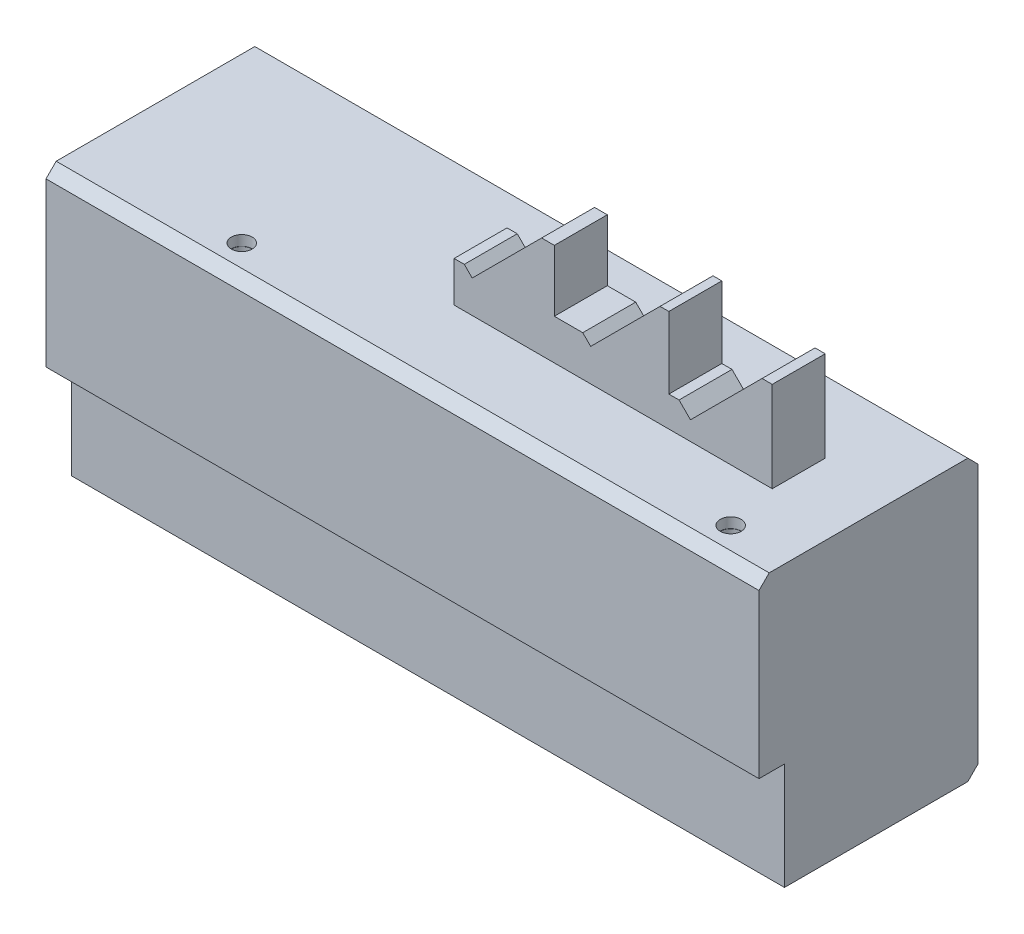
from build123d import *

# Parameters (mm, degrees)
SKETCH_16_W                  = 70
SKETCH_16_H                  = 21.5
EXTRUDE_6_DEPTH              = 2.5
SKETCH_38_W                  = 70
SKETCH_38_H                  = 21.5
EXTRUDE_9_DEPTH              = 25
HOLE_WIZARD_G1_8_2_D         = 8.8
HOLE_WIZARD_G1_8_2_DEPTH     = 62
HOLE_WIZARD_G1_8_2_TIP       = 2.643786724
HOLE_WIZARD_M4_1_D           = 3.3
HOLE_WIZARD_M4_1_DEPTH       = 4.5
HOLE_WIZARD_M4_1_CSINK_D     = 4.05
HOLE_WIZARD_M4_1_CSINK_ANGLE = 90
HOLE_WIZARD_M4_1_TIP         = 0.991420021
CHAMFER_2_SIZE               = 1
SKETCH_49_W                  = 2.5
SKETCH_49_H                  = 10.5
CUT_EXTRUDE_7_DEPTH          = 76.103678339
SKETCH_48_R                  = 1.025
CUT_EXTRUDE_8_DEPTH          = 1
SKETCH_50_R                  = 1
CUT_EXTRUDE_9_DEPTH          = 3.2
SKETCH_51_W                  = 36
SKETCH_51_H                  = 11.5
EXTRUDE_10_DEPTH             = 10
CUT_EXTRUDE_10_DEPTH         = 47.067884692
SKETCH_54_W                  = 3
SKETCH_54_H                  = 11.5
CUT_EXTRUDE_12_DEPTH         = 3.964466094
CUT_EXTRUDE_15_DEPTH         = 1
CUT_EXTRUDE_16_DEPTH         = 1.5
CUT_EXTRUDE_17_DEPTH         = 0.8
CUT_EXTRUDE_18_DEPTH         = 47.067884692
CUT_EXTRUDE_19_DEPTH         = 3
SKETCH_62_W                  = 1.764832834
SKETCH_62_H                  = 5.2
CUT_EXTRUDE_20_DEPTH         = 3.964466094
CUT_EXTRUDE_21_DEPTH         = 23


with BuildPart() as part:
    # Sketch 16 → Extrude 6 (new body)
    with BuildSketch(Plane(origin=(0, 0, 0), x_dir=(1, 0, 0), z_dir=(0, 1, 0))):
        Rectangle(SKETCH_16_W, SKETCH_16_H)
    extrude(amount=EXTRUDE_6_DEPTH)

    # Sketch 38 → Extrude 9 (add)
    with BuildSketch(Plane.XZ):
        Rectangle(SKETCH_38_W, SKETCH_38_H)
    extrude(amount=EXTRUDE_9_DEPTH)

    # Hole Wizard G1_8 _2
    with Locations(Plane.ZY.offset(35)):
        with Locations((0, -11.25)):
            Hole(HOLE_WIZARD_G1_8_2_D / 2, depth=HOLE_WIZARD_G1_8_2_DEPTH)
            with Locations((0, 0, -(HOLE_WIZARD_G1_8_2_DEPTH + HOLE_WIZARD_G1_8_2_TIP / 2))):  # 118° drill point
                Cone(0, HOLE_WIZARD_G1_8_2_D / 2, HOLE_WIZARD_G1_8_2_TIP, mode=Mode.SUBTRACT)

    # Hole Wizard M4 _1
    with Locations(Plane(origin=(-25, -25, 0), x_dir=(0, 0, -1), z_dir=(0, -1, 0))):
        with Locations((0, 0), (0, 50)):
            CounterSinkHole(HOLE_WIZARD_M4_1_D / 2, HOLE_WIZARD_M4_1_CSINK_D / 2, depth=HOLE_WIZARD_M4_1_DEPTH, counter_sink_angle=HOLE_WIZARD_M4_1_CSINK_ANGLE)
            with Locations((0, 0, -(HOLE_WIZARD_M4_1_DEPTH + HOLE_WIZARD_M4_1_TIP / 2))):  # 118° drill point
                Cone(0, HOLE_WIZARD_M4_1_D / 2, HOLE_WIZARD_M4_1_TIP, mode=Mode.SUBTRACT)

    # Chamfer 2
    chamfer_2_edges = [part.edges().sort_by_distance(p)[0] for p in [
        (0, 2.5, 10.75),
        (0, -25, -10.75),
        (0, -25, 10.75),
        (0, 2.5, -10.75),
    ]]
    chamfer(chamfer_2_edges, length=CHAMFER_2_SIZE)

    # Sketch 49 → Cut-Extrude 7 (cut, through all)
    with BuildSketch(Plane.ZY.offset(35)):
        with Locations((9.5, -19.75)):
            Rectangle(SKETCH_49_W, SKETCH_49_H)
    extrude(amount=-CUT_EXTRUDE_7_DEPTH, mode=Mode.SUBTRACT)

    # Sketch 48 → Cut-Extrude 8 (cut)
    with BuildSketch(Plane(origin=(0, 2.5, 0), x_dir=(1, 0, 0), z_dir=(0, 1, 0))):
        with Locations(Location((29.07036674, -7.6, 0), (0, 0, 270))):
            Circle(SKETCH_48_R)
        with Locations(Location((-18.92963326, -7.6, 0), (0, 0, 270))):
            Circle(SKETCH_48_R)
    extrude(amount=-CUT_EXTRUDE_8_DEPTH, mode=Mode.SUBTRACT)

    # Sketch 50 → Cut-Extrude 9 (cut)
    with BuildSketch(Plane(origin=(0, 2.5, 0), x_dir=(1, 0, 0), z_dir=(0, 1, 0))):
        with Locations(Location((-18.92963326, -7.6, 0), (0, 0, 270))):
            Circle(SKETCH_50_R)
        with Locations(Location((29.07036674, -7.6, 0), (0, 0, 270))):
            Circle(SKETCH_50_R)
    extrude(amount=-CUT_EXTRUDE_9_DEPTH, mode=Mode.SUBTRACT)

    # Sketch 51 → Extrude 10 (add)
    with BuildSketch(Plane(origin=(0, 2.5, 0), x_dir=(1, 0, 0), z_dir=(0, 1, 0))):
        with Locations((10, 0)):
            Rectangle(SKETCH_51_W, SKETCH_51_H)
    extrude(amount=EXTRUDE_10_DEPTH)

    # Sketch 52 → Cut-Extrude 10 (cut, through all)
    with BuildSketch(Plane(origin=(0, 0, -5.75), x_dir=(-1, 0, 0), z_dir=(0, 0, -1))):
        Polygon((2.235167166, 6.464466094), (8, 6.464466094), (8, 12.5), (-5.356001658, 12.5), (1.457349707, 5.686648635), align=None)
        Polygon((-28.12276674, 12.5), (-19.972232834, 4.349466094), (-18.848468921, 5.473230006), (-17.848468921, 5.473230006), (-17.848468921, 12.5), align=None)
        Polygon((-16.983401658, 12.5), (-10.174050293, 5.690648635), (-9.396232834, 6.468466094), (-6.607126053, 6.468466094), (-6.607126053, 12.5), align=None)
    extrude(amount=-CUT_EXTRUDE_10_DEPTH, mode=Mode.SUBTRACT)

    # Sketch 54 → Cut-Extrude 12 (cut)
    with BuildSketch(Plane(origin=(0, 6.464466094, 0), x_dir=(1, 0, 0), z_dir=(0, 1, 0))):
        with Locations((-6.5, 0)):
            Rectangle(SKETCH_54_W, SKETCH_54_H)
    extrude(amount=-CUT_EXTRUDE_12_DEPTH, mode=Mode.SUBTRACT)

    # Sketch 57 → Cut-Extrude 15 (cut)
    with BuildSketch(Plane.XY.offset(5.75)):
        Polygon((19.972232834, 4.349466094), (18.848468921, 5.473230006), (17.848468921, 5.473230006), (17.848468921, 12.5), (16.983401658, 12.5), (10.174050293, 5.690648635), (9.396232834, 6.468466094), (6.607126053, 6.468466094), (6.607126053, 12.5), (5.356001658, 12.5), (-1.457349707, 5.686648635), (-2.235167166, 6.464466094), (-5, 6.464466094), (-5, 2.5), (28, 2.5), (28, 12.37723326), align=None)
    extrude(amount=-CUT_EXTRUDE_15_DEPTH, mode=Mode.SUBTRACT)

    # Sketch 58 → Cut-Extrude 16 (cut)
    with BuildSketch(Plane.XY.offset(4.75)):
        Polygon((5.356001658, 12.5), (-1.457349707, 5.686648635), (-2.235167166, 6.464466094), (-5, 6.464466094), (-5, 2.5), (28, 2.5), (28, 12.37723326), (19.972232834, 4.349466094), (18.848468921, 5.473230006), (17.848468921, 5.473230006), (17.848468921, 12.5), (16.983401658, 12.5), (10.174050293, 5.690648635), (9.396232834, 6.468466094), (6.607126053, 6.468466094), (6.607126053, 12.5), align=None)
    extrude(amount=-CUT_EXTRUDE_16_DEPTH, mode=Mode.SUBTRACT)

    # Sketch 59 → Cut-Extrude 17 (cut)
    with BuildSketch(Plane.XY.offset(3.25)):
        Polygon((9.396232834, 6.468466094), (6.607126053, 6.468466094), (6.607126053, 12.5), (5.356001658, 12.5), (-1.457349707, 5.686648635), (-2.235167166, 6.464466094), (-5, 6.464466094), (-5, 2.5), (28, 2.5), (28, 12.37723326), (19.972232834, 4.349466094), (18.848468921, 5.473230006), (17.848468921, 5.473230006), (17.848468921, 12.5), (16.983401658, 12.5), (10.174050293, 5.690648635), align=None)
    extrude(amount=-CUT_EXTRUDE_17_DEPTH, mode=Mode.SUBTRACT)

    # Sketch 60 → Cut-Extrude 18 (cut, through all)
    with BuildSketch(Plane(origin=(0, 0, -5.75), x_dir=(-1, 0, 0), z_dir=(0, 0, -1))):
        Polygon((-28, 12.37723326), (-28, 11.37723326), (-27, 11.37723326), align=None)
    extrude(amount=-CUT_EXTRUDE_18_DEPTH, mode=Mode.SUBTRACT)

    # Sketch 61 → Cut-Extrude 19 (cut)
    with BuildSketch(Plane(origin=(0, 0, -5.75), x_dir=(-1, 0, 0), z_dir=(0, 0, -1))):
        Polygon((-19.972232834, 4.349466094), (-27, 11.37723326), (-28, 11.37723326), (-28, 2.5), (5, 2.5), (5, 6.464466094), (2.235167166, 6.464466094), (1.457349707, 5.686648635), (-5.356001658, 12.5), (-6.607126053, 12.5), (-6.607126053, 6.468466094), (-9.396232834, 6.468466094), (-10.174050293, 5.690648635), (-16.983401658, 12.5), (-17.848468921, 12.5), (-17.848468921, 5.473230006), (-18.848468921, 5.473230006), align=None)
    extrude(amount=-CUT_EXTRUDE_19_DEPTH, mode=Mode.SUBTRACT)

    # Sketch 62 → Cut-Extrude 20 (cut)
    with BuildSketch(Plane(origin=(0, 6.464466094, 0), x_dir=(1, 0, 0), z_dir=(0, 1, 0))):
        with Locations((-4.117583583, 0.15)):
            Rectangle(SKETCH_62_W, SKETCH_62_H)
    extrude(amount=-CUT_EXTRUDE_20_DEPTH, mode=Mode.SUBTRACT)

    # Sketch 63 → Cut-Extrude 21 (cut)
    with BuildSketch(Plane(origin=(0, 12.5, 0), x_dir=(1, 0, 0), z_dir=(0, 1, 0))):
        with BuildLine():
            Line((0.449325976, 0.35), (3.449325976, 0.35))
            ThreePointArc((3.449325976, 0.35), (4.449325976, -0.65), (3.449325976, -1.65))
            Line((3.449325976, -1.65), (0.449325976, -1.65))
            ThreePointArc((0.449325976, -1.65), (-0.550674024, -0.65), (0.449325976, 0.35))
        make_face()
        with BuildLine():
            Line((12.079325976, 0.35), (15.079325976, 0.35))
            ThreePointArc((15.079325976, 0.35), (16.079325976, -0.65), (15.079325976, -1.65))
            Line((15.079325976, -1.65), (12.079325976, -1.65))
            ThreePointArc((12.079325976, -1.65), (11.079325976, -0.65), (12.079325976, 0.35))
        make_face()
        with BuildLine():
            Line((22.079325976, 0.35), (25.079325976, 0.35))
            ThreePointArc((25.079325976, 0.35), (26.079325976, -0.65), (25.079325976, -1.65))
            Line((25.079325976, -1.65), (22.079325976, -1.65))
            ThreePointArc((22.079325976, -1.65), (21.079325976, -0.65), (22.079325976, 0.35))
        make_face()
    extrude(amount=-CUT_EXTRUDE_21_DEPTH, mode=Mode.SUBTRACT)


solid = part.part
